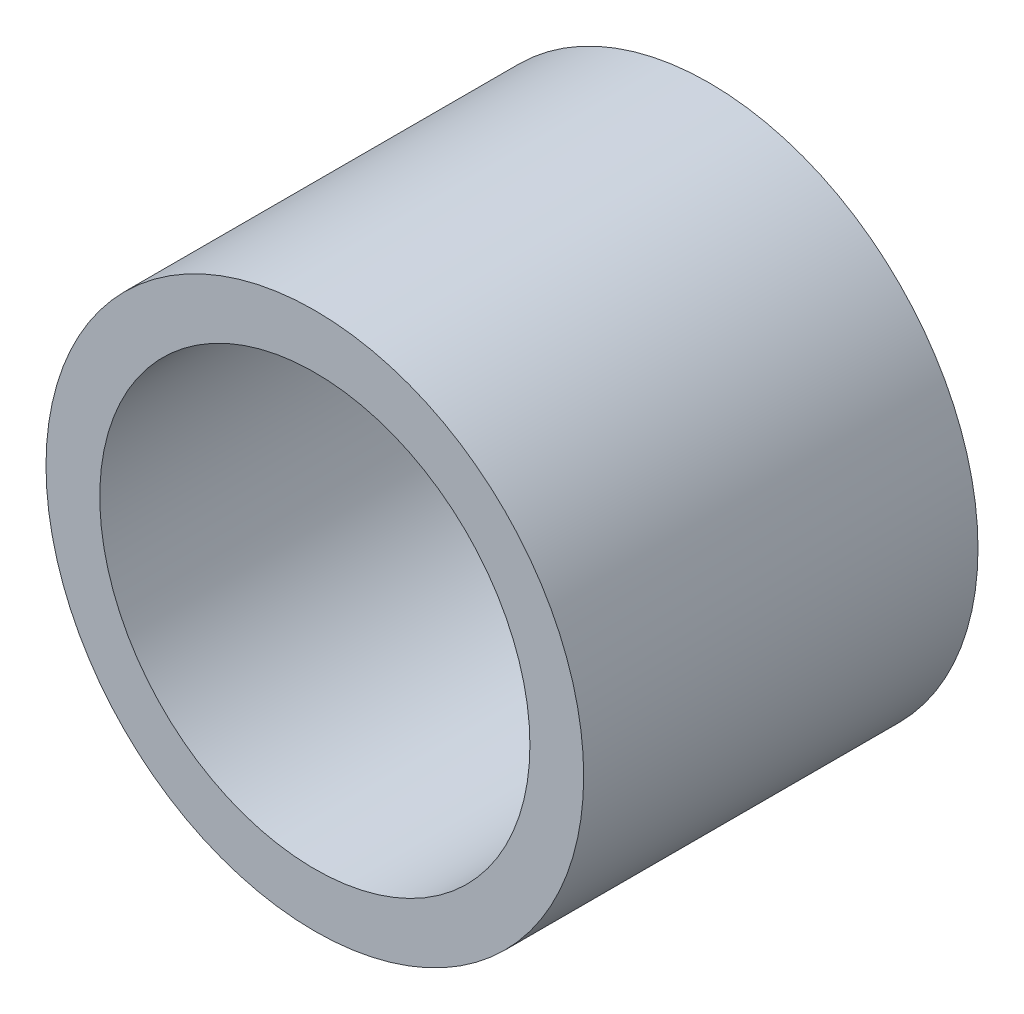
ISO-10303-21;
HEADER;
FILE_DESCRIPTION(('STEP AP214'),'2;1');
FILE_NAME('part.step','',(''),(''),'','','');
FILE_SCHEMA(('AUTOMOTIVE_DESIGN { 1 0 10303 214 1 1 1 1 }'));
ENDSEC;
DATA;
#1=APPLICATION_CONTEXT('core data for automotive mechanical design processes');
#2=APPLICATION_PROTOCOL_DEFINITION('international standard','automotive_design',2000,#1);
#3=PRODUCT_CONTEXT('',#1,'mechanical');
#4=PRODUCT('Part','Part','',(#3));
#5=PRODUCT_RELATED_PRODUCT_CATEGORY('part','',(#4));
#6=PRODUCT_DEFINITION_FORMATION('','',#4);
#7=PRODUCT_DEFINITION_CONTEXT('part definition',#1,'design');
#8=PRODUCT_DEFINITION('design','',#6,#7);
#9=PRODUCT_DEFINITION_SHAPE('','',#8);
#10=(LENGTH_UNIT() NAMED_UNIT(*) SI_UNIT(.MILLI.,.METRE.));
#11=(NAMED_UNIT(*) PLANE_ANGLE_UNIT() SI_UNIT($,.RADIAN.));
#12=(NAMED_UNIT(*) SI_UNIT($,.STERADIAN.) SOLID_ANGLE_UNIT());
#13=UNCERTAINTY_MEASURE_WITH_UNIT(LENGTH_MEASURE(1.E-05),#10,'distance_accuracy_value','');
#14=(GEOMETRIC_REPRESENTATION_CONTEXT(3) GLOBAL_UNCERTAINTY_ASSIGNED_CONTEXT((#13)) GLOBAL_UNIT_ASSIGNED_CONTEXT((#10,
#11,#12)) REPRESENTATION_CONTEXT('',''));
#15=CARTESIAN_POINT('',(0.,0.,0.));
#16=DIRECTION('',(0.,0.,1.));
#17=DIRECTION('',(1.,0.,0.));
#18=AXIS2_PLACEMENT_3D('',#15,#16,#17);
#19=CARTESIAN_POINT('',(0.,0.,11.));
#20=DIRECTION('',(0.,0.,1.));
#21=DIRECTION('',(1.,0.,0.));
#22=AXIS2_PLACEMENT_3D('',#19,#20,#21);
#23=PLANE('',#22);
#24=CARTESIAN_POINT('',(0.,0.,11.));
#25=DIRECTION('',(0.,0.,1.));
#26=DIRECTION('',(1.,0.,0.));
#27=AXIS2_PLACEMENT_3D('',#24,#25,#26);
#28=CIRCLE('',#27,7.5);
#29=CARTESIAN_POINT('',(7.5,0.,11.));
#30=VERTEX_POINT('',#29);
#31=EDGE_CURVE('E8',#30,#30,#28,.T.);
#32=ORIENTED_EDGE('',*,*,#31,.T.);
#33=EDGE_LOOP('',(#32));
#34=FACE_BOUND('',#33,.T.);
#35=CARTESIAN_POINT('',(0.,0.,11.));
#36=DIRECTION('',(0.,0.,1.));
#37=DIRECTION('',(1.,0.,0.));
#38=AXIS2_PLACEMENT_3D('',#35,#36,#37);
#39=CIRCLE('',#38,6.);
#40=CARTESIAN_POINT('',(6.,0.,11.));
#41=VERTEX_POINT('',#40);
#42=EDGE_CURVE('E23',#41,#41,#39,.T.);
#43=ORIENTED_EDGE('',*,*,#42,.F.);
#44=EDGE_LOOP('',(#43));
#45=FACE_BOUND('',#44,.T.);
#46=ADVANCED_FACE('F12',(#34,#45),#23,.T.);
#47=CARTESIAN_POINT('',(0.,0.,0.));
#48=DIRECTION('',(0.,0.,1.));
#49=DIRECTION('',(1.,0.,0.));
#50=AXIS2_PLACEMENT_3D('',#47,#48,#49);
#51=PLANE('',#50);
#52=CARTESIAN_POINT('',(0.,0.,0.));
#53=DIRECTION('',(0.,0.,1.));
#54=DIRECTION('',(1.,0.,0.));
#55=AXIS2_PLACEMENT_3D('',#52,#53,#54);
#56=CIRCLE('',#55,7.5);
#57=CARTESIAN_POINT('',(7.5,0.,0.));
#58=VERTEX_POINT('',#57);
#59=EDGE_CURVE('E16',#58,#58,#56,.T.);
#60=ORIENTED_EDGE('',*,*,#59,.F.);
#61=EDGE_LOOP('',(#60));
#62=FACE_BOUND('',#61,.T.);
#63=CARTESIAN_POINT('',(0.,0.,0.));
#64=DIRECTION('',(0.,0.,1.));
#65=DIRECTION('',(1.,0.,0.));
#66=AXIS2_PLACEMENT_3D('',#63,#64,#65);
#67=CIRCLE('',#66,6.);
#68=CARTESIAN_POINT('',(6.,0.,0.));
#69=VERTEX_POINT('',#68);
#70=EDGE_CURVE('E25',#69,#69,#67,.T.);
#71=ORIENTED_EDGE('',*,*,#70,.T.);
#72=EDGE_LOOP('',(#71));
#73=FACE_BOUND('',#72,.T.);
#74=ADVANCED_FACE('F35',(#62,#73),#51,.F.);
#75=CARTESIAN_POINT('',(0.,0.,11.));
#76=DIRECTION('',(0.,0.,-1.));
#77=DIRECTION('',(-1.,0.,0.));
#78=AXIS2_PLACEMENT_3D('',#75,#76,#77);
#79=CYLINDRICAL_SURFACE('',#78,7.5);
#80=ORIENTED_EDGE('',*,*,#31,.F.);
#81=EDGE_LOOP('',(#80));
#82=FACE_BOUND('',#81,.T.);
#83=ORIENTED_EDGE('',*,*,#59,.T.);
#84=EDGE_LOOP('',(#83));
#85=FACE_BOUND('',#84,.T.);
#86=ADVANCED_FACE('F14',(#82,#85),#79,.T.);
#87=CARTESIAN_POINT('',(0.,0.,11.));
#88=DIRECTION('',(0.,0.,-1.));
#89=DIRECTION('',(-1.,0.,0.));
#90=AXIS2_PLACEMENT_3D('',#87,#88,#89);
#91=CYLINDRICAL_SURFACE('',#90,6.);
#92=ORIENTED_EDGE('',*,*,#42,.T.);
#93=EDGE_LOOP('',(#92));
#94=FACE_BOUND('',#93,.T.);
#95=ORIENTED_EDGE('',*,*,#70,.F.);
#96=EDGE_LOOP('',(#95));
#97=FACE_BOUND('',#96,.T.);
#98=ADVANCED_FACE('F31',(#94,#97),#91,.F.);
#99=CLOSED_SHELL('',(#46,#74,#86,#98));
#100=MANIFOLD_SOLID_BREP('B1',#99);
#101=ADVANCED_BREP_SHAPE_REPRESENTATION('',(#18,#100),#14);
#102=SHAPE_DEFINITION_REPRESENTATION(#9,#101);
ENDSEC;
END-ISO-10303-21;
